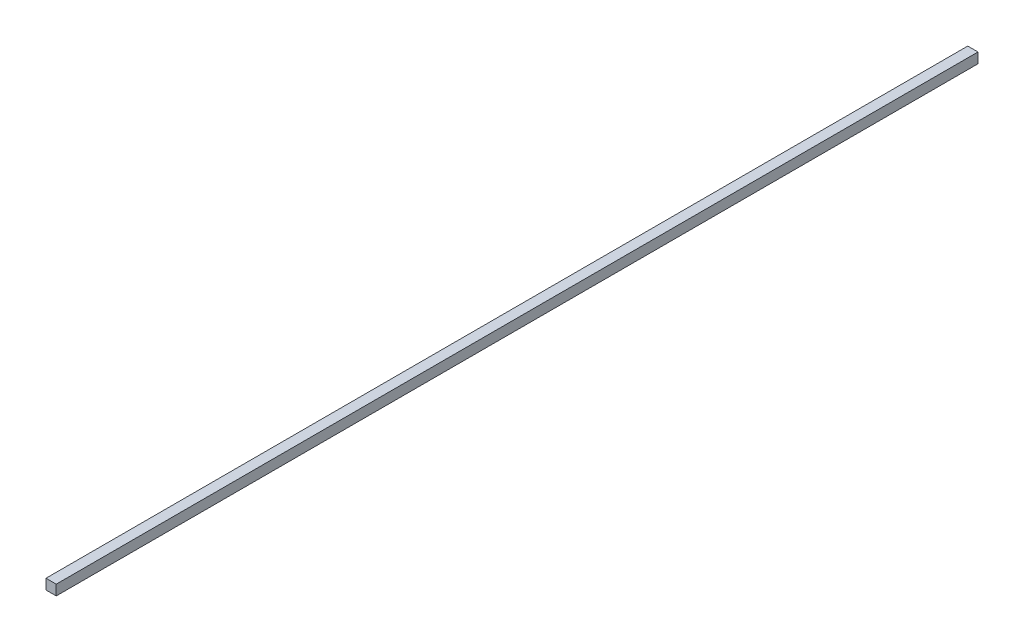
ISO-10303-21;
HEADER;
FILE_DESCRIPTION(('STEP AP214'),'2;1');
FILE_NAME('part.step','',(''),(''),'','','');
FILE_SCHEMA(('AUTOMOTIVE_DESIGN { 1 0 10303 214 1 1 1 1 }'));
ENDSEC;
DATA;
#1=APPLICATION_CONTEXT('core data for automotive mechanical design processes');
#2=APPLICATION_PROTOCOL_DEFINITION('international standard','automotive_design',2000,#1);
#3=PRODUCT_CONTEXT('',#1,'mechanical');
#4=PRODUCT('Part','Part','',(#3));
#5=PRODUCT_RELATED_PRODUCT_CATEGORY('part','',(#4));
#6=PRODUCT_DEFINITION_FORMATION('','',#4);
#7=PRODUCT_DEFINITION_CONTEXT('part definition',#1,'design');
#8=PRODUCT_DEFINITION('design','',#6,#7);
#9=PRODUCT_DEFINITION_SHAPE('','',#8);
#10=(LENGTH_UNIT() NAMED_UNIT(*) SI_UNIT(.MILLI.,.METRE.));
#11=(NAMED_UNIT(*) PLANE_ANGLE_UNIT() SI_UNIT($,.RADIAN.));
#12=(NAMED_UNIT(*) SI_UNIT($,.STERADIAN.) SOLID_ANGLE_UNIT());
#13=UNCERTAINTY_MEASURE_WITH_UNIT(LENGTH_MEASURE(1.E-05),#10,'distance_accuracy_value','');
#14=(GEOMETRIC_REPRESENTATION_CONTEXT(3) GLOBAL_UNCERTAINTY_ASSIGNED_CONTEXT((#13)) GLOBAL_UNIT_ASSIGNED_CONTEXT((#10,
#11,#12)) REPRESENTATION_CONTEXT('',''));
#15=CARTESIAN_POINT('',(0.,0.,0.));
#16=DIRECTION('',(0.,0.,1.));
#17=DIRECTION('',(1.,0.,0.));
#18=AXIS2_PLACEMENT_3D('',#15,#16,#17);
#19=CARTESIAN_POINT('',(-1.,1.,90.));
#20=DIRECTION('',(1.,0.,0.));
#21=DIRECTION('',(0.,0.,-1.));
#22=AXIS2_PLACEMENT_3D('',#19,#20,#21);
#23=PLANE('',#22);
#24=DIRECTION('',(0.,-1.,0.));
#25=VECTOR('',#24,1.);
#26=CARTESIAN_POINT('',(-1.,1.,-90.));
#27=LINE('',#26,#25);
#28=CARTESIAN_POINT('',(-1.,1.,-90.));
#29=VERTEX_POINT('',#28);
#30=CARTESIAN_POINT('',(-1.,-1.,-90.));
#31=VERTEX_POINT('',#30);
#32=EDGE_CURVE('E70',#29,#31,#27,.T.);
#33=ORIENTED_EDGE('',*,*,#32,.T.);
#34=DIRECTION('',(0.,0.,-1.));
#35=VECTOR('',#34,1.);
#36=CARTESIAN_POINT('',(-1.,-1.,90.));
#37=LINE('',#36,#35);
#38=CARTESIAN_POINT('',(-1.,-1.,90.));
#39=VERTEX_POINT('',#38);
#40=EDGE_CURVE('E11',#39,#31,#37,.T.);
#41=ORIENTED_EDGE('',*,*,#40,.F.);
#42=DIRECTION('',(0.,-1.,0.));
#43=VECTOR('',#42,1.);
#44=CARTESIAN_POINT('',(-1.,1.,90.));
#45=LINE('',#44,#43);
#46=CARTESIAN_POINT('',(-1.,1.,90.));
#47=VERTEX_POINT('',#46);
#48=EDGE_CURVE('E88',#47,#39,#45,.T.);
#49=ORIENTED_EDGE('',*,*,#48,.F.);
#50=DIRECTION('',(0.,0.,-1.));
#51=VECTOR('',#50,1.);
#52=CARTESIAN_POINT('',(-1.,1.,90.));
#53=LINE('',#52,#51);
#54=EDGE_CURVE('E82',#47,#29,#53,.T.);
#55=ORIENTED_EDGE('',*,*,#54,.T.);
#56=EDGE_LOOP('',(#33,#41,#49,#55));
#57=FACE_BOUND('',#56,.T.);
#58=ADVANCED_FACE('F26',(#57),#23,.F.);
#59=CARTESIAN_POINT('',(-1.,-1.,90.));
#60=DIRECTION('',(0.,1.,0.));
#61=DIRECTION('',(0.,0.,1.));
#62=AXIS2_PLACEMENT_3D('',#59,#60,#61);
#63=PLANE('',#62);
#64=DIRECTION('',(1.,0.,0.));
#65=VECTOR('',#64,1.);
#66=CARTESIAN_POINT('',(-1.,-1.,-90.));
#67=LINE('',#66,#65);
#68=CARTESIAN_POINT('',(1.,-1.,-90.));
#69=VERTEX_POINT('',#68);
#70=EDGE_CURVE('E66',#31,#69,#67,.T.);
#71=ORIENTED_EDGE('',*,*,#70,.T.);
#72=DIRECTION('',(0.,0.,-1.));
#73=VECTOR('',#72,1.);
#74=CARTESIAN_POINT('',(1.,-1.,90.));
#75=LINE('',#74,#73);
#76=CARTESIAN_POINT('',(1.,-1.,90.));
#77=VERTEX_POINT('',#76);
#78=EDGE_CURVE('E33',#77,#69,#75,.T.);
#79=ORIENTED_EDGE('',*,*,#78,.F.);
#80=DIRECTION('',(1.,0.,0.));
#81=VECTOR('',#80,1.);
#82=CARTESIAN_POINT('',(-1.,-1.,90.));
#83=LINE('',#82,#81);
#84=EDGE_CURVE('E78',#39,#77,#83,.T.);
#85=ORIENTED_EDGE('',*,*,#84,.F.);
#86=ORIENTED_EDGE('',*,*,#40,.T.);
#87=EDGE_LOOP('',(#71,#79,#85,#86));
#88=FACE_BOUND('',#87,.T.);
#89=ADVANCED_FACE('F77',(#88),#63,.F.);
#90=CARTESIAN_POINT('',(1.,1.,90.));
#91=DIRECTION('',(-1.,0.,0.));
#92=DIRECTION('',(0.,-1.,0.));
#93=AXIS2_PLACEMENT_3D('',#90,#91,#92);
#94=PLANE('',#93);
#95=DIRECTION('',(0.,1.,0.));
#96=VECTOR('',#95,1.);
#97=CARTESIAN_POINT('',(1.,1.,-90.));
#98=LINE('',#97,#96);
#99=CARTESIAN_POINT('',(1.,1.,-90.));
#100=VERTEX_POINT('',#99);
#101=EDGE_CURVE('E71',#69,#100,#98,.T.);
#102=ORIENTED_EDGE('',*,*,#101,.T.);
#103=DIRECTION('',(0.,0.,-1.));
#104=VECTOR('',#103,1.);
#105=CARTESIAN_POINT('',(1.,1.,90.));
#106=LINE('',#105,#104);
#107=CARTESIAN_POINT('',(1.,1.,90.));
#108=VERTEX_POINT('',#107);
#109=EDGE_CURVE('E94',#108,#100,#106,.T.);
#110=ORIENTED_EDGE('',*,*,#109,.F.);
#111=DIRECTION('',(0.,1.,0.));
#112=VECTOR('',#111,1.);
#113=CARTESIAN_POINT('',(1.,1.,90.));
#114=LINE('',#113,#112);
#115=EDGE_CURVE('E45',#77,#108,#114,.T.);
#116=ORIENTED_EDGE('',*,*,#115,.F.);
#117=ORIENTED_EDGE('',*,*,#78,.T.);
#118=EDGE_LOOP('',(#102,#110,#116,#117));
#119=FACE_BOUND('',#118,.T.);
#120=ADVANCED_FACE('F97',(#119),#94,.F.);
#121=CARTESIAN_POINT('',(-1.,1.,90.));
#122=DIRECTION('',(0.,-1.,0.));
#123=DIRECTION('',(1.,0.,0.));
#124=AXIS2_PLACEMENT_3D('',#121,#122,#123);
#125=PLANE('',#124);
#126=DIRECTION('',(-1.,0.,0.));
#127=VECTOR('',#126,1.);
#128=CARTESIAN_POINT('',(-1.,1.,-90.));
#129=LINE('',#128,#127);
#130=EDGE_CURVE('E86',#100,#29,#129,.T.);
#131=ORIENTED_EDGE('',*,*,#130,.T.);
#132=ORIENTED_EDGE('',*,*,#54,.F.);
#133=DIRECTION('',(-1.,0.,0.));
#134=VECTOR('',#133,1.);
#135=CARTESIAN_POINT('',(-1.,1.,90.));
#136=LINE('',#135,#134);
#137=EDGE_CURVE('E40',#108,#47,#136,.T.);
#138=ORIENTED_EDGE('',*,*,#137,.F.);
#139=ORIENTED_EDGE('',*,*,#109,.T.);
#140=EDGE_LOOP('',(#131,#132,#138,#139));
#141=FACE_BOUND('',#140,.T.);
#142=ADVANCED_FACE('F99',(#141),#125,.F.);
#143=CARTESIAN_POINT('',(-1.,-1.,90.));
#144=DIRECTION('',(0.,0.,1.));
#145=DIRECTION('',(1.,0.,0.));
#146=AXIS2_PLACEMENT_3D('',#143,#144,#145);
#147=PLANE('',#146);
#148=ORIENTED_EDGE('',*,*,#48,.T.);
#149=ORIENTED_EDGE('',*,*,#84,.T.);
#150=ORIENTED_EDGE('',*,*,#115,.T.);
#151=ORIENTED_EDGE('',*,*,#137,.T.);
#152=EDGE_LOOP('',(#148,#149,#150,#151));
#153=FACE_BOUND('',#152,.T.);
#154=ADVANCED_FACE('F100',(#153),#147,.T.);
#155=CARTESIAN_POINT('',(-1.,-1.,-90.));
#156=DIRECTION('',(0.,0.,1.));
#157=DIRECTION('',(1.,0.,0.));
#158=AXIS2_PLACEMENT_3D('',#155,#156,#157);
#159=PLANE('',#158);
#160=ORIENTED_EDGE('',*,*,#32,.F.);
#161=ORIENTED_EDGE('',*,*,#130,.F.);
#162=ORIENTED_EDGE('',*,*,#101,.F.);
#163=ORIENTED_EDGE('',*,*,#70,.F.);
#164=EDGE_LOOP('',(#160,#161,#162,#163));
#165=FACE_BOUND('',#164,.T.);
#166=ADVANCED_FACE('F67',(#165),#159,.F.);
#167=CLOSED_SHELL('',(#58,#89,#120,#142,#154,#166));
#168=MANIFOLD_SOLID_BREP('B2',#167);
#169=ADVANCED_BREP_SHAPE_REPRESENTATION('',(#18,#168),#14);
#170=SHAPE_DEFINITION_REPRESENTATION(#9,#169);
ENDSEC;
END-ISO-10303-21;
